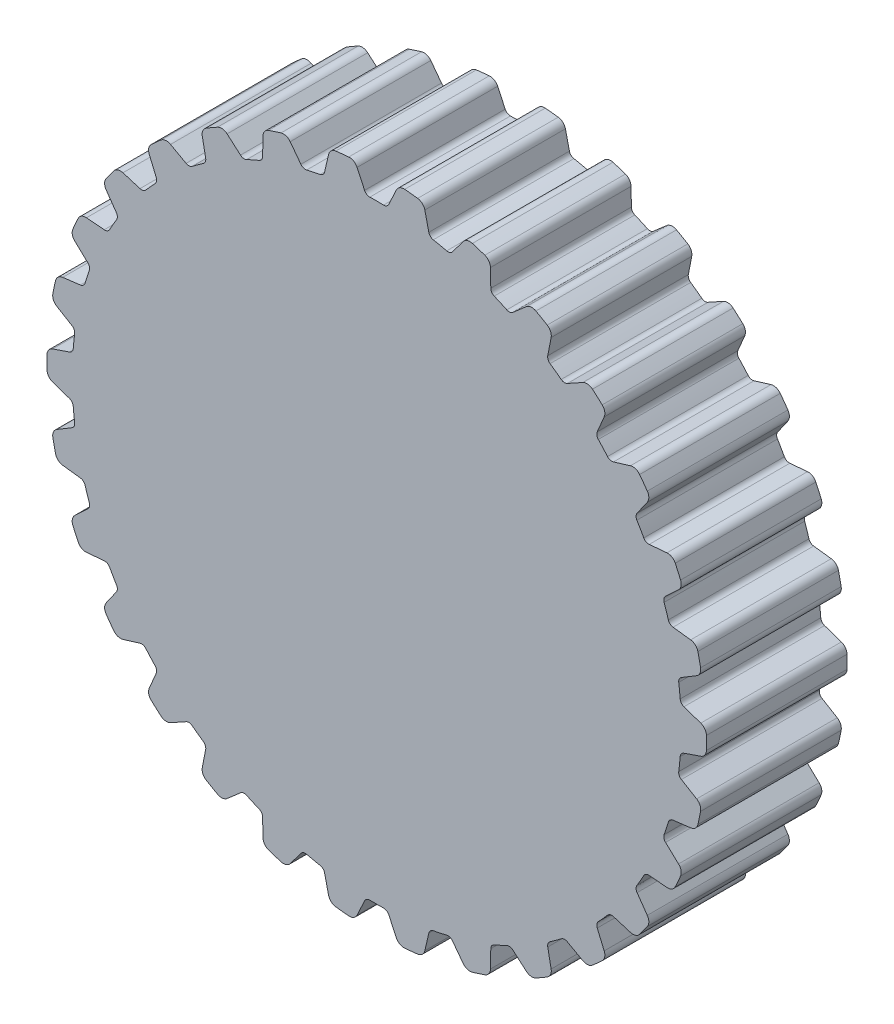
from build123d import *

# Parameters (mm, degrees)
BOSS_EXTRU_1_DEPTH           = 5
R_P_TITION_CIRCULAIRE1_COUNT = 30


with BuildPart() as part:
    # Esquisse3 → Boss.-Extru.1 (new, symmetric)
    with BuildSketch(Plane.XY):
        with BuildLine():
            Line((0, 0), (-2.452048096, 23.329679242))
            ThreePointArc((-2.452048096, 23.329679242), (-2.221196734, 23.352789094), (-1.990128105, 23.373614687))
            ThreePointArc((-1.990128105, 23.373614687), (-1.638621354, 23.295043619), (-1.395441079, 23.029348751))
            Line((-1.395441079, 23.029348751), (-0.861124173, 21.883502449))
            ThreePointArc((-0.861124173, 21.883502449), (-0.709694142, 21.712785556), (-0.489559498, 21.652651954))
            ThreePointArc((-0.489559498, 21.652651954), (0, 21.658185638), (0.489559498, 21.652651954))
            ThreePointArc((0.489559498, 21.652651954), (0.709694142, 21.712785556), (0.861124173, 21.883502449))
            Line((0.861124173, 21.883502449), (1.395441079, 23.029348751))
            ThreePointArc((1.395441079, 23.029348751), (1.638621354, 23.295043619), (1.990128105, 23.373614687))
            ThreePointArc((1.990128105, 23.373614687), (2.221196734, 23.352789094), (2.452048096, 23.329679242))
            Line((2.452048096, 23.329679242), (0, 0))
        make_face()
    boss_extru_1 = extrude(amount=BOSS_EXTRU_1_DEPTH, both=True)

    # R_p_tition circulaire1: Boss.-Extru.1 ×30 about axis
    r_p_tition_circulaire1_axis = Axis((0, 0, 0), (0, 0, 1))
    for i in range(1, R_P_TITION_CIRCULAIRE1_COUNT):
        add(boss_extru_1.rotate(r_p_tition_circulaire1_axis, i * 360 / R_P_TITION_CIRCULAIRE1_COUNT))


solid = part.part
